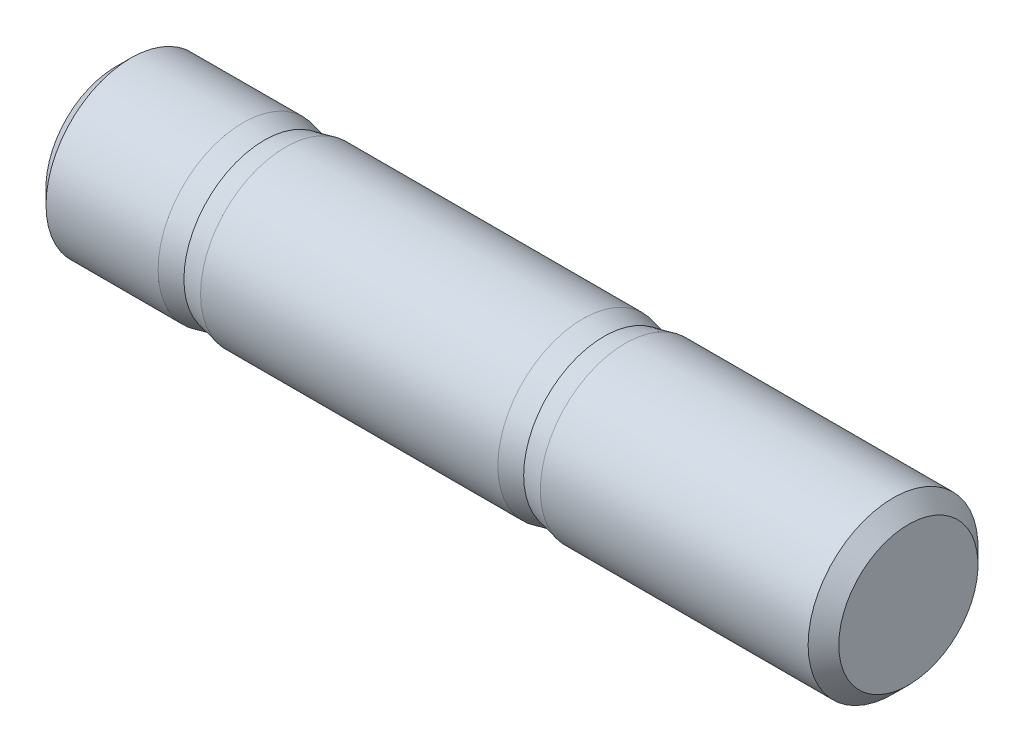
ISO-10303-21;
HEADER;
FILE_DESCRIPTION(('STEP AP214'),'2;1');
FILE_NAME('part.step','',(''),(''),'','','');
FILE_SCHEMA(('AUTOMOTIVE_DESIGN { 1 0 10303 214 1 1 1 1 }'));
ENDSEC;
DATA;
#1=APPLICATION_CONTEXT('core data for automotive mechanical design processes');
#2=APPLICATION_PROTOCOL_DEFINITION('international standard','automotive_design',2000,#1);
#3=PRODUCT_CONTEXT('',#1,'mechanical');
#4=PRODUCT('Part','Part','',(#3));
#5=PRODUCT_RELATED_PRODUCT_CATEGORY('part','',(#4));
#6=PRODUCT_DEFINITION_FORMATION('','',#4);
#7=PRODUCT_DEFINITION_CONTEXT('part definition',#1,'design');
#8=PRODUCT_DEFINITION('design','',#6,#7);
#9=PRODUCT_DEFINITION_SHAPE('','',#8);
#10=(LENGTH_UNIT() NAMED_UNIT(*) SI_UNIT(.MILLI.,.METRE.));
#11=(NAMED_UNIT(*) PLANE_ANGLE_UNIT() SI_UNIT($,.RADIAN.));
#12=(NAMED_UNIT(*) SI_UNIT($,.STERADIAN.) SOLID_ANGLE_UNIT());
#13=UNCERTAINTY_MEASURE_WITH_UNIT(LENGTH_MEASURE(1.E-05),#10,'distance_accuracy_value','');
#14=(GEOMETRIC_REPRESENTATION_CONTEXT(3) GLOBAL_UNCERTAINTY_ASSIGNED_CONTEXT((#13)) GLOBAL_UNIT_ASSIGNED_CONTEXT((#10,
#11,#12)) REPRESENTATION_CONTEXT('',''));
#15=CARTESIAN_POINT('',(0.,0.,0.));
#16=DIRECTION('',(0.,0.,1.));
#17=DIRECTION('',(1.,0.,0.));
#18=AXIS2_PLACEMENT_3D('',#15,#16,#17);
#19=CARTESIAN_POINT('',(6.,0.,0.));
#20=DIRECTION('',(-1.,0.,0.));
#21=DIRECTION('',(0.,0.,1.));
#22=AXIS2_PLACEMENT_3D('',#19,#20,#21);
#23=CONICAL_SURFACE('',#22,2.675,0.213368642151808);
#24=CARTESIAN_POINT('',(4.5,0.,0.));
#25=DIRECTION('',(-1.,0.,0.));
#26=DIRECTION('',(0.,0.,1.));
#27=AXIS2_PLACEMENT_3D('',#24,#25,#26);
#28=CIRCLE('',#27,3.);
#29=CARTESIAN_POINT('',(4.5,0.,3.));
#30=VERTEX_POINT('',#29);
#31=EDGE_CURVE('E67',#30,#30,#28,.T.);
#32=ORIENTED_EDGE('',*,*,#31,.F.);
#33=EDGE_LOOP('',(#32));
#34=FACE_BOUND('',#33,.T.);
#35=CARTESIAN_POINT('',(5.25,0.,0.));
#36=DIRECTION('',(1.,0.,0.));
#37=DIRECTION('',(0.,0.,-1.));
#38=AXIS2_PLACEMENT_3D('',#35,#36,#37);
#39=CIRCLE('',#38,2.8375);
#40=CARTESIAN_POINT('',(5.25,0.,-2.8375));
#41=VERTEX_POINT('',#40);
#42=EDGE_CURVE('E10',#41,#41,#39,.T.);
#43=ORIENTED_EDGE('',*,*,#42,.F.);
#44=EDGE_LOOP('',(#43));
#45=FACE_BOUND('',#44,.T.);
#46=ADVANCED_FACE('F43',(#34,#45),#23,.T.);
#47=CARTESIAN_POINT('',(0.,0.,0.));
#48=DIRECTION('',(1.,0.,0.));
#49=DIRECTION('',(0.,0.,-1.));
#50=AXIS2_PLACEMENT_3D('',#47,#48,#49);
#51=PLANE('',#50);
#52=CARTESIAN_POINT('',(0.,0.,0.));
#53=DIRECTION('',(1.,0.,0.));
#54=DIRECTION('',(0.,0.,-1.));
#55=AXIS2_PLACEMENT_3D('',#52,#53,#54);
#56=CIRCLE('',#55,2.45850000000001);
#57=CARTESIAN_POINT('',(0.,0.,-2.45850000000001));
#58=VERTEX_POINT('',#57);
#59=EDGE_CURVE('E68',#58,#58,#56,.F.);
#60=ORIENTED_EDGE('',*,*,#59,.T.);
#61=EDGE_LOOP('',(#60));
#62=FACE_BOUND('',#61,.T.);
#63=ADVANCED_FACE('F100',(#62),#51,.F.);
#64=CARTESIAN_POINT('',(-1.31084166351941,0.,0.));
#65=DIRECTION('',(-1.,0.,0.));
#66=DIRECTION('',(0.,0.,1.));
#67=AXIS2_PLACEMENT_3D('',#64,#65,#66);
#68=CYLINDRICAL_SURFACE('',#67,3.);
#69=CARTESIAN_POINT('',(0.541499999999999,0.,0.));
#70=DIRECTION('',(1.,0.,0.));
#71=DIRECTION('',(0.,0.,-1.));
#72=AXIS2_PLACEMENT_3D('',#69,#70,#71);
#73=CIRCLE('',#72,3.);
#74=CARTESIAN_POINT('',(0.541499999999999,0.,-3.));
#75=VERTEX_POINT('',#74);
#76=EDGE_CURVE('E62',#75,#75,#73,.T.);
#77=ORIENTED_EDGE('',*,*,#76,.T.);
#78=EDGE_LOOP('',(#77));
#79=FACE_BOUND('',#78,.T.);
#80=ORIENTED_EDGE('',*,*,#31,.T.);
#81=EDGE_LOOP('',(#80));
#82=FACE_BOUND('',#81,.T.);
#83=ADVANCED_FACE('F106',(#79,#82),#68,.T.);
#84=CARTESIAN_POINT('',(0.,0.,0.));
#85=DIRECTION('',(1.,0.,0.));
#86=DIRECTION('',(0.,0.,-1.));
#87=AXIS2_PLACEMENT_3D('',#84,#85,#86);
#88=CONICAL_SURFACE('',#87,2.45850000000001,0.785398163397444);
#89=ORIENTED_EDGE('',*,*,#76,.F.);
#90=EDGE_LOOP('',(#89));
#91=FACE_BOUND('',#90,.T.);
#92=ORIENTED_EDGE('',*,*,#59,.F.);
#93=EDGE_LOOP('',(#92));
#94=FACE_BOUND('',#93,.T.);
#95=ADVANCED_FACE('F92',(#91,#94),#88,.T.);
#96=CARTESIAN_POINT('',(6.,0.,0.));
#97=DIRECTION('',(1.,0.,0.));
#98=DIRECTION('',(0.,0.,-1.));
#99=AXIS2_PLACEMENT_3D('',#96,#97,#98);
#100=CONICAL_SURFACE('',#99,3.,0.213368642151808);
#101=CARTESIAN_POINT('',(6.,0.,0.));
#102=DIRECTION('',(-1.,0.,0.));
#103=DIRECTION('',(0.,0.,1.));
#104=AXIS2_PLACEMENT_3D('',#101,#102,#103);
#105=CIRCLE('',#104,3.);
#106=CARTESIAN_POINT('',(6.,0.,3.));
#107=VERTEX_POINT('',#106);
#108=EDGE_CURVE('E72',#107,#107,#105,.T.);
#109=ORIENTED_EDGE('',*,*,#108,.T.);
#110=EDGE_LOOP('',(#109));
#111=FACE_BOUND('',#110,.T.);
#112=ORIENTED_EDGE('',*,*,#42,.T.);
#113=EDGE_LOOP('',(#112));
#114=FACE_BOUND('',#113,.T.);
#115=ADVANCED_FACE('F88',(#111,#114),#100,.T.);
#116=CARTESIAN_POINT('',(18.,0.,0.));
#117=DIRECTION('',(-1.,0.,0.));
#118=DIRECTION('',(0.,0.,1.));
#119=AXIS2_PLACEMENT_3D('',#116,#117,#118);
#120=CONICAL_SURFACE('',#119,2.675,0.213368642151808);
#121=CARTESIAN_POINT('',(16.5,0.,0.));
#122=DIRECTION('',(-1.,0.,0.));
#123=DIRECTION('',(0.,0.,1.));
#124=AXIS2_PLACEMENT_3D('',#121,#122,#123);
#125=CIRCLE('',#124,3.);
#126=CARTESIAN_POINT('',(16.5,0.,3.));
#127=VERTEX_POINT('',#126);
#128=EDGE_CURVE('E76',#127,#127,#125,.T.);
#129=ORIENTED_EDGE('',*,*,#128,.F.);
#130=EDGE_LOOP('',(#129));
#131=FACE_BOUND('',#130,.T.);
#132=CARTESIAN_POINT('',(17.25,0.,0.));
#133=DIRECTION('',(-1.,0.,0.));
#134=DIRECTION('',(0.,0.,1.));
#135=AXIS2_PLACEMENT_3D('',#132,#133,#134);
#136=CIRCLE('',#135,2.8375);
#137=CARTESIAN_POINT('',(17.25,0.,2.8375));
#138=VERTEX_POINT('',#137);
#139=EDGE_CURVE('E49',#138,#138,#136,.T.);
#140=ORIENTED_EDGE('',*,*,#139,.T.);
#141=EDGE_LOOP('',(#140));
#142=FACE_BOUND('',#141,.T.);
#143=ADVANCED_FACE('F83',(#131,#142),#120,.T.);
#144=CARTESIAN_POINT('',(4.97743089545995,0.,0.));
#145=DIRECTION('',(-1.,0.,0.));
#146=DIRECTION('',(0.,0.,1.));
#147=AXIS2_PLACEMENT_3D('',#144,#145,#146);
#148=CYLINDRICAL_SURFACE('',#147,3.);
#149=ORIENTED_EDGE('',*,*,#108,.F.);
#150=EDGE_LOOP('',(#149));
#151=FACE_BOUND('',#150,.T.);
#152=ORIENTED_EDGE('',*,*,#128,.T.);
#153=EDGE_LOOP('',(#152));
#154=FACE_BOUND('',#153,.T.);
#155=ADVANCED_FACE('F85',(#151,#154),#148,.T.);
#156=CARTESIAN_POINT('',(28.,3.,0.));
#157=DIRECTION('',(-1.,0.,0.));
#158=DIRECTION('',(0.,0.,1.));
#159=AXIS2_PLACEMENT_3D('',#156,#157,#158);
#160=PLANE('',#159);
#161=CARTESIAN_POINT('',(28.,0.,0.));
#162=DIRECTION('',(-1.,0.,0.));
#163=DIRECTION('',(0.,0.,1.));
#164=AXIS2_PLACEMENT_3D('',#161,#162,#163);
#165=CIRCLE('',#164,2.45849999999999);
#166=CARTESIAN_POINT('',(28.,0.,2.45849999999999));
#167=VERTEX_POINT('',#166);
#168=EDGE_CURVE('E53',#167,#167,#165,.F.);
#169=ORIENTED_EDGE('',*,*,#168,.T.);
#170=EDGE_LOOP('',(#169));
#171=FACE_BOUND('',#170,.T.);
#172=ADVANCED_FACE('F95',(#171),#160,.F.);
#173=CARTESIAN_POINT('',(27.4585,0.,0.));
#174=DIRECTION('',(-1.,0.,0.));
#175=DIRECTION('',(0.,0.,1.));
#176=AXIS2_PLACEMENT_3D('',#173,#174,#175);
#177=CONICAL_SURFACE('',#176,3.,0.785398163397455);
#178=ORIENTED_EDGE('',*,*,#168,.F.);
#179=EDGE_LOOP('',(#178));
#180=FACE_BOUND('',#179,.T.);
#181=CARTESIAN_POINT('',(27.4585,0.,0.));
#182=DIRECTION('',(-1.,0.,0.));
#183=DIRECTION('',(0.,0.,1.));
#184=AXIS2_PLACEMENT_3D('',#181,#182,#183);
#185=CIRCLE('',#184,3.);
#186=CARTESIAN_POINT('',(27.4585,0.,3.));
#187=VERTEX_POINT('',#186);
#188=EDGE_CURVE('E59',#187,#187,#185,.T.);
#189=ORIENTED_EDGE('',*,*,#188,.F.);
#190=EDGE_LOOP('',(#189));
#191=FACE_BOUND('',#190,.T.);
#192=ADVANCED_FACE('F44',(#180,#191),#177,.T.);
#193=CARTESIAN_POINT('',(-1.31084166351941,0.,0.));
#194=DIRECTION('',(-1.,0.,0.));
#195=DIRECTION('',(0.,0.,1.));
#196=AXIS2_PLACEMENT_3D('',#193,#194,#195);
#197=CYLINDRICAL_SURFACE('',#196,3.);
#198=ORIENTED_EDGE('',*,*,#188,.T.);
#199=EDGE_LOOP('',(#198));
#200=FACE_BOUND('',#199,.T.);
#201=CARTESIAN_POINT('',(18.,0.,0.));
#202=DIRECTION('',(-1.,0.,0.));
#203=DIRECTION('',(0.,0.,1.));
#204=AXIS2_PLACEMENT_3D('',#201,#202,#203);
#205=CIRCLE('',#204,3.);
#206=CARTESIAN_POINT('',(18.,0.,3.));
#207=VERTEX_POINT('',#206);
#208=EDGE_CURVE('E75',#207,#207,#205,.T.);
#209=ORIENTED_EDGE('',*,*,#208,.F.);
#210=EDGE_LOOP('',(#209));
#211=FACE_BOUND('',#210,.T.);
#212=ADVANCED_FACE('F132',(#200,#211),#197,.T.);
#213=CARTESIAN_POINT('',(18.,0.,0.));
#214=DIRECTION('',(1.,0.,0.));
#215=DIRECTION('',(0.,0.,-1.));
#216=AXIS2_PLACEMENT_3D('',#213,#214,#215);
#217=CONICAL_SURFACE('',#216,3.,0.213368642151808);
#218=ORIENTED_EDGE('',*,*,#208,.T.);
#219=EDGE_LOOP('',(#218));
#220=FACE_BOUND('',#219,.T.);
#221=ORIENTED_EDGE('',*,*,#139,.F.);
#222=EDGE_LOOP('',(#221));
#223=FACE_BOUND('',#222,.T.);
#224=ADVANCED_FACE('F113',(#220,#223),#217,.T.);
#225=CLOSED_SHELL('',(#46,#63,#83,#95,#115,#143,#155,#172,#192,#212,#224));
#226=MANIFOLD_SOLID_BREP('B2',#225);
#227=ADVANCED_BREP_SHAPE_REPRESENTATION('',(#18,#226),#14);
#228=SHAPE_DEFINITION_REPRESENTATION(#9,#227);
ENDSEC;
END-ISO-10303-21;
